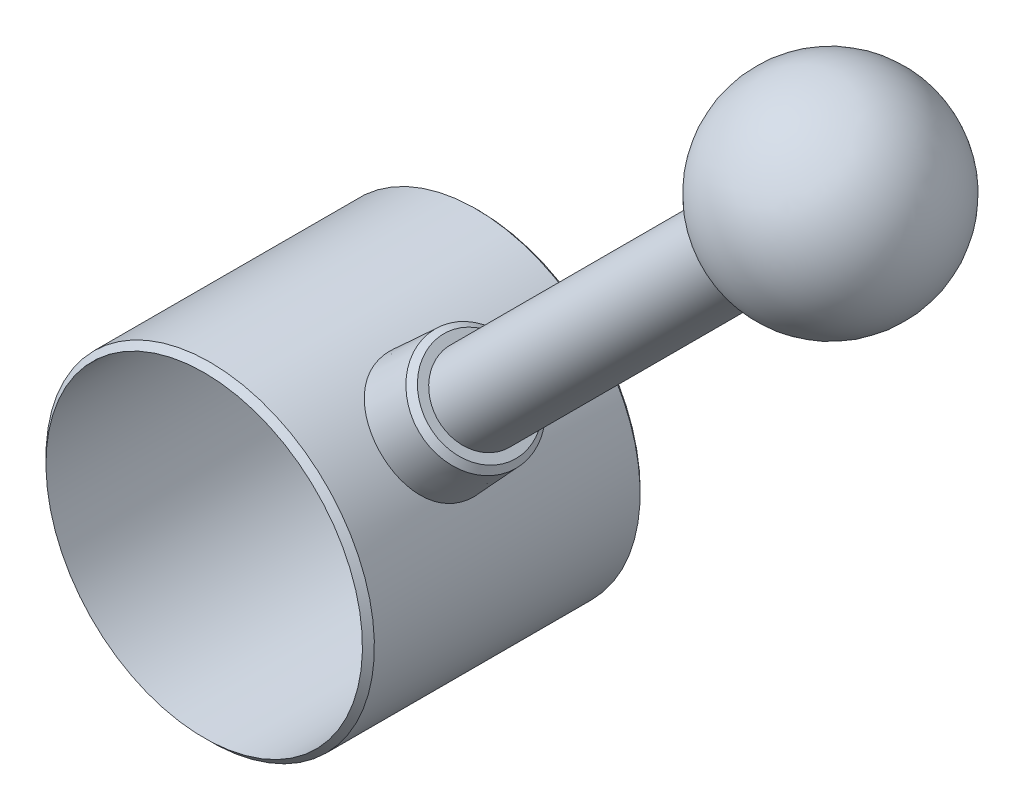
ISO-10303-21;
HEADER;
FILE_DESCRIPTION(('STEP AP214'),'2;1');
FILE_NAME('part.step','',(''),(''),'','','');
FILE_SCHEMA(('AUTOMOTIVE_DESIGN { 1 0 10303 214 1 1 1 1 }'));
ENDSEC;
DATA;
#1=APPLICATION_CONTEXT('core data for automotive mechanical design processes');
#2=APPLICATION_PROTOCOL_DEFINITION('international standard','automotive_design',2000,#1);
#3=PRODUCT_CONTEXT('',#1,'mechanical');
#4=PRODUCT('Part','Part','',(#3));
#5=PRODUCT_RELATED_PRODUCT_CATEGORY('part','',(#4));
#6=PRODUCT_DEFINITION_FORMATION('','',#4);
#7=PRODUCT_DEFINITION_CONTEXT('part definition',#1,'design');
#8=PRODUCT_DEFINITION('design','',#6,#7);
#9=PRODUCT_DEFINITION_SHAPE('','',#8);
#10=(LENGTH_UNIT() NAMED_UNIT(*) SI_UNIT(.MILLI.,.METRE.));
#11=(NAMED_UNIT(*) PLANE_ANGLE_UNIT() SI_UNIT($,.RADIAN.));
#12=(NAMED_UNIT(*) SI_UNIT($,.STERADIAN.) SOLID_ANGLE_UNIT());
#13=UNCERTAINTY_MEASURE_WITH_UNIT(LENGTH_MEASURE(1.E-05),#10,'distance_accuracy_value','');
#14=(GEOMETRIC_REPRESENTATION_CONTEXT(3) GLOBAL_UNCERTAINTY_ASSIGNED_CONTEXT((#13)) GLOBAL_UNIT_ASSIGNED_CONTEXT((#10,
#11,#12)) REPRESENTATION_CONTEXT('',''));
#15=CARTESIAN_POINT('',(0.,0.,0.));
#16=DIRECTION('',(0.,0.,1.));
#17=DIRECTION('',(1.,0.,0.));
#18=AXIS2_PLACEMENT_3D('',#15,#16,#17);
#19=CARTESIAN_POINT('',(84.8528137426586,84.8528137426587,25.999999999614));
#20=DIRECTION('',(-0.707106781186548,-0.707106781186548,0.));
#21=DIRECTION('',(0.,0.,1.));
#22=AXIS2_PLACEMENT_3D('',#19,#20,#21);
#23=SPHERICAL_SURFACE('',#22,17.5);
#24=CARTESIAN_POINT('',(97.2271824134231,97.2271824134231,26.0000001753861));
#25=VERTEX_POINT('',#24);
#26=VERTEX_LOOP('',#25);
#27=FACE_BOUND('',#26,.T.);
#28=CARTESIAN_POINT('',(73.8926586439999,73.892658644,26.));
#29=DIRECTION('',(-0.707106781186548,-0.707106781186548,0.));
#30=DIRECTION('',(0.707106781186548,-0.707106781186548,0.));
#31=AXIS2_PLACEMENT_3D('',#28,#29,#30);
#32=CIRCLE('',#31,8.12403843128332);
#33=CARTESIAN_POINT('',(79.6372213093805,68.1480959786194,26.));
#34=VERTEX_POINT('',#33);
#35=EDGE_CURVE('E18',#34,#34,#32,.T.);
#36=ORIENTED_EDGE('',*,*,#35,.F.);
#37=EDGE_LOOP('',(#36));
#38=FACE_BOUND('',#37,.T.);
#39=ADVANCED_FACE('F14',(#27,#38),#23,.T.);
#40=CARTESIAN_POINT('',(79.706156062,68.079161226,34.2215268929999));
#41=DIRECTION('',(-0.707106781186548,-0.707106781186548,0.));
#42=DIRECTION('',(-0.707106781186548,0.707106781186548,0.));
#43=AXIS2_PLACEMENT_3D('',#40,#41,#42);
#44=PLANE('',#43);
#45=CARTESIAN_POINT('',(73.8926586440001,73.8926586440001,26.));
#46=DIRECTION('',(-0.707106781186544,-0.707106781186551,0.));
#47=DIRECTION('',(0.707106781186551,-0.707106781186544,0.));
#48=AXIS2_PLACEMENT_3D('',#45,#46,#47);
#49=CIRCLE('',#48,6.99999999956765);
#50=CARTESIAN_POINT('',(78.8424061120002,68.942911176,26.));
#51=VERTEX_POINT('',#50);
#52=EDGE_CURVE('E34',#51,#51,#49,.F.);
#53=ORIENTED_EDGE('',*,*,#52,.T.);
#54=EDGE_LOOP('',(#53));
#55=FACE_BOUND('',#54,.T.);
#56=ORIENTED_EDGE('',*,*,#35,.T.);
#57=EDGE_LOOP('',(#56));
#58=FACE_BOUND('',#57,.T.);
#59=ADVANCED_FACE('F28',(#55,#58),#44,.T.);
#60=CARTESIAN_POINT('',(73.8926586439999,73.892658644,26.));
#61=DIRECTION('',(-0.707106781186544,-0.707106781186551,0.));
#62=DIRECTION('',(0.707106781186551,-0.707106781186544,0.));
#63=AXIS2_PLACEMENT_3D('',#60,#61,#62);
#64=CYLINDRICAL_SURFACE('',#63,6.99999999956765);
#65=ORIENTED_EDGE('',*,*,#52,.F.);
#66=EDGE_LOOP('',(#65));
#67=FACE_BOUND('',#66,.T.);
#68=CARTESIAN_POINT('',(26.1629509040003,26.1629509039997,26.));
#69=DIRECTION('',(-0.707106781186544,-0.707106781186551,0.));
#70=DIRECTION('',(0.707106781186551,-0.707106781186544,0.));
#71=AXIS2_PLACEMENT_3D('',#68,#69,#70);
#72=CIRCLE('',#71,6.99999999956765);
#73=CARTESIAN_POINT('',(31.1126983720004,21.2132034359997,26.));
#74=VERTEX_POINT('',#73);
#75=EDGE_CURVE('E37',#74,#74,#72,.T.);
#76=ORIENTED_EDGE('',*,*,#75,.F.);
#77=EDGE_LOOP('',(#76));
#78=FACE_BOUND('',#77,.T.);
#79=ADVANCED_FACE('F51',(#67,#78),#64,.T.);
#80=CARTESIAN_POINT('',(20.051210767,32.2746910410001,34.6433057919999));
#81=DIRECTION('',(0.707106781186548,0.707106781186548,0.));
#82=DIRECTION('',(0.707106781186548,-0.707106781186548,0.));
#83=AXIS2_PLACEMENT_3D('',#80,#81,#82);
#84=PLANE('',#83);
#85=ORIENTED_EDGE('',*,*,#75,.T.);
#86=EDGE_LOOP('',(#85));
#87=FACE_BOUND('',#86,.T.);
#88=CARTESIAN_POINT('',(26.1629509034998,26.1629509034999,26.));
#89=DIRECTION('',(-0.70710678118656,-0.707106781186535,0.));
#90=DIRECTION('',(0.707106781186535,-0.70710678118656,0.));
#91=AXIS2_PLACEMENT_3D('',#88,#89,#90);
#92=CIRCLE('',#91,8.54081600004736);
#93=CARTESIAN_POINT('',(32.2022198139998,20.1236819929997,26.));
#94=VERTEX_POINT('',#93);
#95=EDGE_CURVE('E77',#94,#94,#92,.F.);
#96=ORIENTED_EDGE('',*,*,#95,.T.);
#97=EDGE_LOOP('',(#96));
#98=FACE_BOUND('',#97,.T.);
#99=ADVANCED_FACE('F54',(#87,#98),#84,.T.);
#100=CARTESIAN_POINT('',(26.1629509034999,26.1629509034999,26.));
#101=DIRECTION('',(-0.70710678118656,-0.707106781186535,0.));
#102=DIRECTION('',(0.707106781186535,-0.70710678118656,0.));
#103=AXIS2_PLACEMENT_3D('',#100,#101,#102);
#104=CONICAL_SURFACE('',#103,8.54081600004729,0.785398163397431);
#105=ORIENTED_EDGE('',*,*,#95,.F.);
#106=EDGE_LOOP('',(#105));
#107=FACE_BOUND('',#106,.T.);
#108=CARTESIAN_POINT('',(25.4558441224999,25.4558441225,26.));
#109=DIRECTION('',(-0.707106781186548,-0.707106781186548,0.));
#110=DIRECTION('',(-0.707106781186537,0.707106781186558,0.));
#111=AXIS2_PLACEMENT_3D('',#108,#109,#110);
#112=CIRCLE('',#111,9.54081599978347);
#113=CARTESIAN_POINT('',(18.709468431,32.2022198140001,26.));
#114=VERTEX_POINT('',#113);
#115=EDGE_CURVE('E75',#114,#114,#112,.F.);
#116=ORIENTED_EDGE('',*,*,#115,.T.);
#117=EDGE_LOOP('',(#116));
#118=FACE_BOUND('',#117,.T.);
#119=ADVANCED_FACE('F56',(#107,#118),#104,.T.);
#120=CARTESIAN_POINT('',(25.4558441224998,25.4558441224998,26.));
#121=DIRECTION('',(-0.70710678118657,-0.707106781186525,0.));
#122=DIRECTION('',(0.707106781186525,-0.70710678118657,0.));
#123=AXIS2_PLACEMENT_3D('',#120,#121,#122);
#124=CONICAL_SURFACE('',#123,9.54081599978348,0.0407937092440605);
#125=ORIENTED_EDGE('',*,*,#115,.F.);
#126=EDGE_LOOP('',(#125));
#127=FACE_BOUND('',#126,.T.);
#128=CARTESIAN_POINT('',(11.0785009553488,25.1697599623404,26.0000000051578));
#129=CARTESIAN_POINT('',(11.0785003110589,25.1697600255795,26.2654053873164));
#130=CARTESIAN_POINT('',(11.08909680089,25.1651041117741,26.530804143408));
#131=CARTESIAN_POINT('',(11.1313063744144,25.1464619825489,27.0596893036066));
#132=CARTESIAN_POINT('',(11.1629269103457,25.1324724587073,27.3231749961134));
#133=CARTESIAN_POINT('',(11.2467174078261,25.0950881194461,27.8465436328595));
#134=CARTESIAN_POINT('',(11.2989153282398,25.0716805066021,28.1064211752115));
#135=CARTESIAN_POINT('',(11.4230184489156,25.015380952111,28.6203848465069));
#136=CARTESIAN_POINT('',(11.4949248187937,24.9824884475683,28.8744706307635));
#137=CARTESIAN_POINT('',(11.6570932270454,24.9072305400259,29.3743627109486));
#138=CARTESIAN_POINT('',(11.7472969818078,24.8648951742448,29.6201924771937));
#139=CARTESIAN_POINT('',(11.9449322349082,24.7705586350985,30.1029023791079));
#140=CARTESIAN_POINT('',(12.0523640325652,24.7185572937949,30.3397823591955));
#141=CARTESIAN_POINT('',(12.2830337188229,24.6047477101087,30.8031748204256));
#142=CARTESIAN_POINT('',(12.4062674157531,24.5429420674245,31.0296900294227));
#143=CARTESIAN_POINT('',(12.6671456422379,24.4093199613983,31.4712812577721));
#144=CARTESIAN_POINT('',(12.8047954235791,24.3374998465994,31.6863530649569));
#145=CARTESIAN_POINT('',(13.0997487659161,24.1800706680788,32.1136848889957));
#146=CARTESIAN_POINT('',(13.2576721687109,24.0939719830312,32.325337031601));
#147=CARTESIAN_POINT('',(13.5858849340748,23.9104386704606,32.7336069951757));
#148=CARTESIAN_POINT('',(13.75617467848,23.8130036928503,32.9302243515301));
#149=CARTESIAN_POINT('',(14.1074422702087,23.6066003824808,33.3073931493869));
#150=CARTESIAN_POINT('',(14.2884252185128,23.4976265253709,33.4879368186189));
#151=CARTESIAN_POINT('',(14.6591448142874,23.2681535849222,33.8316954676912));
#152=CARTESIAN_POINT('',(14.8488776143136,23.1476595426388,33.9949179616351));
#153=CARTESIAN_POINT('',(15.2431510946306,22.8900412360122,34.3092760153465));
#154=CARTESIAN_POINT('',(15.4479804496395,22.7524433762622,34.4596626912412));
#155=CARTESIAN_POINT('',(15.8631254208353,22.4649719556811,34.7394635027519));
#156=CARTESIAN_POINT('',(16.0734388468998,22.3151032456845,34.8688858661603));
#157=CARTESIAN_POINT('',(16.4975608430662,22.0034028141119,35.1057629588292));
#158=CARTESIAN_POINT('',(16.7113694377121,21.8415710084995,35.2132175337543));
#159=CARTESIAN_POINT('',(17.1403801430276,21.5065437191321,35.4051825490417));
#160=CARTESIAN_POINT('',(17.3555821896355,21.3333487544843,35.4896940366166));
#161=CARTESIAN_POINT('',(17.7780744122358,20.9824433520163,35.6325119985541));
#162=CARTESIAN_POINT('',(17.9853875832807,20.8050798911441,35.6916032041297));
#163=CARTESIAN_POINT('',(18.3975204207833,20.4415442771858,35.7870184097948));
#164=CARTESIAN_POINT('',(18.6023401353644,20.2553722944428,35.8233428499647));
#165=CARTESIAN_POINT('',(19.0076643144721,19.8755081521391,35.8728504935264));
#166=CARTESIAN_POINT('',(19.2081698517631,19.6818178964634,35.886039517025));
#167=CARTESIAN_POINT('',(19.6032714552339,19.2883248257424,35.8891567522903));
#168=CARTESIAN_POINT('',(19.7978676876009,19.0885221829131,35.8790856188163));
#169=CARTESIAN_POINT('',(20.1712017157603,18.6933999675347,35.8367518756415));
#170=CARTESIAN_POINT('',(20.3502600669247,18.4982746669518,35.8054934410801));
#171=CARTESIAN_POINT('',(20.7005213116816,18.1054594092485,35.7221261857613));
#172=CARTESIAN_POINT('',(20.8717244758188,17.907769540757,35.6700180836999));
#173=CARTESIAN_POINT('',(21.2053634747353,17.5114155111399,35.5454157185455));
#174=CARTESIAN_POINT('',(21.3677989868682,17.3127513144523,35.4729207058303));
#175=CARTESIAN_POINT('',(21.6831756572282,16.9160900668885,35.3081586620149));
#176=CARTESIAN_POINT('',(21.83611659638,16.7180930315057,35.2158911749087));
#177=CARTESIAN_POINT('',(22.1337427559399,16.3220564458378,35.0110932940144));
#178=CARTESIAN_POINT('',(22.2783070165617,16.1240448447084,34.8983332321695));
#179=CARTESIAN_POINT('',(22.5568445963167,15.7320249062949,34.6541121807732));
#180=CARTESIAN_POINT('',(22.6908140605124,15.5380180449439,34.5226444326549));
#181=CARTESIAN_POINT('',(22.9478997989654,15.1557565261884,34.2419394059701));
#182=CARTESIAN_POINT('',(23.0710159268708,14.9675019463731,34.0927018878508));
#183=CARTESIAN_POINT('',(23.3063245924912,14.5983954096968,33.7773945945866));
#184=CARTESIAN_POINT('',(23.4185164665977,14.4175439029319,33.6113237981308));
#185=CARTESIAN_POINT('',(23.637445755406,14.0558916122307,33.2544461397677));
#186=CARTESIAN_POINT('',(23.7436133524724,13.8755636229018,33.0628097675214));
#187=CARTESIAN_POINT('',(23.9440292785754,13.526785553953,32.6631841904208));
#188=CARTESIAN_POINT('',(24.0382772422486,13.358335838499,32.4551944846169));
#189=CARTESIAN_POINT('',(24.2150802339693,13.0351007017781,32.0239667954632));
#190=CARTESIAN_POINT('',(24.2976288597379,12.8803227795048,31.800720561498));
#191=CARTESIAN_POINT('',(24.4511757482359,12.5864015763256,31.3404016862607));
#192=CARTESIAN_POINT('',(24.5221746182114,12.4472574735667,31.1033297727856));
#193=CARTESIAN_POINT('',(24.6538029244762,12.1844951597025,30.613193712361));
#194=CARTESIAN_POINT('',(24.7142644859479,12.0611354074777,30.3599456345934));
#195=CARTESIAN_POINT('',(24.823704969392,11.8342528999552,29.8424478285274));
#196=CARTESIAN_POINT('',(24.8726888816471,11.7307215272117,29.5782029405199));
#197=CARTESIAN_POINT('',(24.9593152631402,11.5452610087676,29.0409328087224));
#198=CARTESIAN_POINT('',(24.9969767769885,11.4632956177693,28.7679231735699));
#199=CARTESIAN_POINT('',(25.0611980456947,11.3222070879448,28.2149076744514));
#200=CARTESIAN_POINT('',(25.0877629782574,11.263073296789,27.9349051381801));
#201=CARTESIAN_POINT('',(25.1291713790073,11.1703728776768,27.3800896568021));
#202=CARTESIAN_POINT('',(25.1443965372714,11.1359751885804,27.1054439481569));
#203=CARTESIAN_POINT('',(25.1646907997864,11.0900395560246,26.5538630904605));
#204=CARTESIAN_POINT('',(25.1697598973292,11.0785016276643,26.2769279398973));
#205=CARTESIAN_POINT('',(25.1697600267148,11.0785003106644,25.7345946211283));
#206=CARTESIAN_POINT('',(25.1651041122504,11.0890968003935,25.469195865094));
#207=CARTESIAN_POINT('',(25.1464619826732,11.1313063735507,24.9403107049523));
#208=CARTESIAN_POINT('',(25.1324724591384,11.1629269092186,24.6768250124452));
#209=CARTESIAN_POINT('',(25.095088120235,11.246717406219,24.153456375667));
#210=CARTESIAN_POINT('',(25.0716805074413,11.2989153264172,23.8935788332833));
#211=CARTESIAN_POINT('',(25.015380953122,11.4230184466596,23.3796151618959));
#212=CARTESIAN_POINT('',(24.9824884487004,11.4949248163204,23.1255293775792));
#213=CARTESIAN_POINT('',(24.907230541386,11.6570932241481,22.6256372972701));
#214=CARTESIAN_POINT('',(24.8648951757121,11.7472969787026,22.3798075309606));
#215=CARTESIAN_POINT('',(24.7705586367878,11.9449322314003,21.897097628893));
#216=CARTESIAN_POINT('',(24.7185572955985,12.052364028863,21.6602176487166));
#217=CARTESIAN_POINT('',(24.6047477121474,12.2830337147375,21.1968251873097));
#218=CARTESIAN_POINT('',(24.5429420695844,12.4062674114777,20.9703099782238));
#219=CARTESIAN_POINT('',(24.4093199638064,12.6671456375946,20.5287187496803));
#220=CARTESIAN_POINT('',(24.3374998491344,12.804795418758,20.3136469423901));
#221=CARTESIAN_POINT('',(24.1800706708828,13.0997487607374,19.8863151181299));
#222=CARTESIAN_POINT('',(24.0939719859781,13.2576721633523,19.6746629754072));
#223=CARTESIAN_POINT('',(23.9104386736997,13.5858849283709,19.2663930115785));
#224=CARTESIAN_POINT('',(23.8130036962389,13.7561746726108,19.0697756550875));
#225=CARTESIAN_POINT('',(23.6066003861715,14.1074422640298,18.692606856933));
#226=CARTESIAN_POINT('',(23.497626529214,14.2884252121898,18.5120631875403));
#227=CARTESIAN_POINT('',(23.2681535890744,14.6591448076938,18.1683045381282));
#228=CARTESIAN_POINT('',(23.1476595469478,14.8488776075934,18.0050820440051));
#229=CARTESIAN_POINT('',(22.8900412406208,15.2431510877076,17.6907239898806));
#230=CARTESIAN_POINT('',(22.7524433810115,15.4479804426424,17.5403373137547));
#231=CARTESIAN_POINT('',(22.4649719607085,15.8631254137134,17.2605365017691));
#232=CARTESIAN_POINT('',(22.3151032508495,16.0734388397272,17.1311141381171));
#233=CARTESIAN_POINT('',(22.0034028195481,16.4975608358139,16.8942370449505));
#234=CARTESIAN_POINT('',(21.8415710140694,16.7113694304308,16.7867824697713));
#235=CARTESIAN_POINT('',(21.5065437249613,17.140380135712,16.5948174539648));
#236=CARTESIAN_POINT('',(21.3333487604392,17.3555821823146,16.5103059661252));
#237=CARTESIAN_POINT('',(20.9824433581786,17.7780744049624,16.3674880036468));
#238=CARTESIAN_POINT('',(20.805079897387,17.9853875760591,16.3083967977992));
#239=CARTESIAN_POINT('',(20.4415442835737,18.3975204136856,16.2129815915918));
#240=CARTESIAN_POINT('',(20.2553723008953,18.6023401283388,16.1766571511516));
#241=CARTESIAN_POINT('',(19.8755081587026,19.0076643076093,16.1271495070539));
#242=CARTESIAN_POINT('',(19.6818179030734,19.2081698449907,16.1139604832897));
#243=CARTESIAN_POINT('',(19.2883248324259,19.6032714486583,16.1108432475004));
#244=CARTESIAN_POINT('',(19.0885221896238,19.7978676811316,16.120914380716));
#245=CARTESIAN_POINT('',(18.6933999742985,20.1712017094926,16.1632481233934));
#246=CARTESIAN_POINT('',(18.4982746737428,20.3502600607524,16.194506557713));
#247=CARTESIAN_POINT('',(18.1054594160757,20.700521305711,16.2778738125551));
#248=CARTESIAN_POINT('',(17.9077695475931,20.8717244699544,16.3299819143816));
#249=CARTESIAN_POINT('',(17.5114155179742,21.2053634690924,16.4545842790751));
#250=CARTESIAN_POINT('',(17.3127513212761,21.3677989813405,16.5270792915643));
#251=CARTESIAN_POINT('',(16.9160900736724,21.6831756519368,16.6918413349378));
#252=CARTESIAN_POINT('',(16.7180930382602,21.8361165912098,16.7841088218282));
#253=CARTESIAN_POINT('',(16.3220564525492,22.1337427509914,16.9889067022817));
#254=CARTESIAN_POINT('',(16.1240448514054,22.2783070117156,17.1016667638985));
#255=CARTESIAN_POINT('',(15.732024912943,22.5568445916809,17.3458878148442));
#256=CARTESIAN_POINT('',(15.5380180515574,22.6908140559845,17.47735556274));
#257=CARTESIAN_POINT('',(15.1557565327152,22.9478997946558,17.7580605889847));
#258=CARTESIAN_POINT('',(14.9675019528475,23.0710159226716,17.9072981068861));
#259=CARTESIAN_POINT('',(14.5983954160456,23.3063245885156,18.2226053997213));
#260=CARTESIAN_POINT('',(14.4175439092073,23.4185164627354,18.388676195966));
#261=CARTESIAN_POINT('',(14.055891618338,23.6374457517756,18.7455538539));
#262=CARTESIAN_POINT('',(13.8755636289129,23.7436133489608,18.9371902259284));
#263=CARTESIAN_POINT('',(13.5267855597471,23.9440292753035,19.3368158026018));
#264=CARTESIAN_POINT('',(13.358335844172,24.0382772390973,19.5448055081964));
#265=CARTESIAN_POINT('',(13.0351007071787,24.2150802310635,19.9760331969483));
#266=CARTESIAN_POINT('',(12.8803227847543,24.2976288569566,20.1992794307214));
#267=CARTESIAN_POINT('',(12.586401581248,24.4511757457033,20.6595983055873));
#268=CARTESIAN_POINT('',(12.4472574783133,24.522174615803,20.8966702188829));
#269=CARTESIAN_POINT('',(12.1844951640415,24.6538029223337,21.3868062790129));
#270=CARTESIAN_POINT('',(12.0611354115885,24.7142644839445,21.640054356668));
#271=CARTESIAN_POINT('',(11.8342529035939,24.8237049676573,22.1575521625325));
#272=CARTESIAN_POINT('',(11.7307215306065,24.8726888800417,22.4217970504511));
#273=CARTESIAN_POINT('',(11.5452610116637,24.9593152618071,22.9590671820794));
#274=CARTESIAN_POINT('',(11.4632956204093,24.996976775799,23.2320768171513));
#275=CARTESIAN_POINT('',(11.3222070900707,25.061198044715,23.7850923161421));
#276=CARTESIAN_POINT('',(11.2630732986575,25.0877629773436,24.0650948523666));
#277=CARTESIAN_POINT('',(11.1703728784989,25.1291713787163,24.619910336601));
#278=CARTESIAN_POINT('',(11.1359751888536,25.144396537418,24.8945560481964));
#279=CARTESIAN_POINT('',(11.0900395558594,25.1646907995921,25.4461369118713));
#280=CARTESIAN_POINT('',(11.0785016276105,25.1697598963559,25.723072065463));
#281=CARTESIAN_POINT('',(11.0785009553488,25.1697599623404,26.0000000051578));
#282=B_SPLINE_CURVE_WITH_KNOTS('',3,(#128,#129,#130,#131,#132,#133,#134,#135,#136,#137,#138,
#139,#140,#141,#142,#143,#144,#145,#146,#147,#148,#149,#150,#151,#152,#153,#154,#155,#156,#157,
#158,#159,#160,#161,#162,#163,#164,#165,#166,#167,#168,#169,#170,#171,#172,#173,#174,#175,#176,
#177,#178,#179,#180,#181,#182,#183,#184,#185,#186,#187,#188,#189,#190,#191,#192,#193,#194,#195,
#196,#197,#198,#199,#200,#201,#202,#203,#204,#205,#206,#207,#208,#209,#210,#211,#212,#213,#214,
#215,#216,#217,#218,#219,#220,#221,#222,#223,#224,#225,#226,#227,#228,#229,#230,#231,#232,#233,
#234,#235,#236,#237,#238,#239,#240,#241,#242,#243,#244,#245,#246,#247,#248,#249,#250,#251,#252,
#253,#254,#255,#256,#257,#258,#259,#260,#261,#262,#263,#264,#265,#266,#267,#268,#269,#270,#271,
#272,#273,#274,#275,#276,#277,#278,#279,#280,#281),.UNSPECIFIED.,.T.,.F.,(4,2,2,2,2,2,2,2,2,2,2,
2,2,2,2,2,2,2,2,2,2,2,2,2,2,2,2,2,2,2,2,2,2,2,2,2,2,2,2,2,2,2,2,2,2,2,2,2,2,2,2,2,2,2,2,2,2,2,2,
2,2,2,2,2,2,2,2,2,2,2,2,2,2,2,2,2,4),(0.,0.7959540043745,1.59219029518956,2.38951219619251,
3.1868814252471,3.98174955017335,4.77663148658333,5.57130300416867,6.36626503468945,
7.1986119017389,8.03098448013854,8.86375738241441,9.69616752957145,10.562014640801,
11.4275211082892,12.2930336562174,13.1585066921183,13.9949144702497,14.8313060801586,
15.6674872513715,16.5036448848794,17.3027126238,18.1017528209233,18.9008224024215,
19.6999104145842,20.5085786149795,21.3175397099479,22.1265117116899,22.935532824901,
23.7858058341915,24.6361048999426,25.4868674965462,26.3375853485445,27.2008157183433,
28.0636700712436,28.9250648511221,29.7860572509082,30.616566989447,31.4470772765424,
32.2430312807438,33.0392675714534,33.8365894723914,34.6339587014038,35.428826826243,
36.223708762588,37.0183802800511,37.8133423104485,38.645689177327,39.4780617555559,
40.3108346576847,41.143244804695,42.0090919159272,42.8745983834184,43.7401109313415,
44.6055839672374,45.4419917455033,46.2783833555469,47.1145645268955,47.9507221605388,
48.7497898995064,49.5488300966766,50.3478996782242,51.1469876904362,51.9556558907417,
52.7646169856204,53.5735889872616,54.3826101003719,55.232883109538,56.0831821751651,
56.9339447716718,57.7846626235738,58.6478929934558,59.5107473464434,60.3721421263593,
61.2331345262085,62.0636442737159,62.8941545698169),.UNSPECIFIED.);
#283=CARTESIAN_POINT('',(11.0785009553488,25.1697599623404,26.0000000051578));
#284=VERTEX_POINT('',#283);
#285=EDGE_CURVE('E68',#284,#284,#282,.T.);
#286=ORIENTED_EDGE('',*,*,#285,.T.);
#287=EDGE_LOOP('',(#286));
#288=FACE_BOUND('',#287,.T.);
#289=ADVANCED_FACE('F59',(#127,#288),#124,.T.);
#290=CARTESIAN_POINT('',(0.,0.,46.5));
#291=DIRECTION('',(0.,0.,-1.));
#292=DIRECTION('',(1.,0.,0.));
#293=AXIS2_PLACEMENT_3D('',#290,#291,#292);
#294=CONICAL_SURFACE('',#293,26.0000000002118,0.78539816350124);
#295=CARTESIAN_POINT('',(0.,0.,46.0000000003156));
#296=DIRECTION('',(0.,0.,-1.));
#297=DIRECTION('',(0.,1.,0.));
#298=AXIS2_PLACEMENT_3D('',#295,#296,#297);
#299=CIRCLE('',#298,26.5);
#300=CARTESIAN_POINT('',(0.,26.5,46.0000000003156));
#301=VERTEX_POINT('',#300);
#302=EDGE_CURVE('E35',#301,#301,#299,.T.);
#303=ORIENTED_EDGE('',*,*,#302,.T.);
#304=EDGE_LOOP('',(#303));
#305=FACE_BOUND('',#304,.T.);
#306=CARTESIAN_POINT('',(0.,0.,45.));
#307=DIRECTION('',(0.,0.,-1.));
#308=DIRECTION('',(-0.707106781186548,0.707106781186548,0.));
#309=AXIS2_PLACEMENT_3D('',#306,#307,#308);
#310=CIRCLE('',#309,27.5000000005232);
#311=CARTESIAN_POINT('',(-19.445436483,19.445436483,45.));
#312=VERTEX_POINT('',#311);
#313=EDGE_CURVE('E74',#312,#312,#310,.F.);
#314=ORIENTED_EDGE('',*,*,#313,.T.);
#315=EDGE_LOOP('',(#314));
#316=FACE_BOUND('',#315,.T.);
#317=ADVANCED_FACE('F64',(#305,#316),#294,.T.);
#318=CARTESIAN_POINT('',(0.,0.,45.));
#319=DIRECTION('',(0.,0.,-1.));
#320=DIRECTION('',(1.,0.,0.));
#321=AXIS2_PLACEMENT_3D('',#318,#319,#320);
#322=CYLINDRICAL_SURFACE('',#321,27.5000000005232);
#323=ORIENTED_EDGE('',*,*,#313,.F.);
#324=EDGE_LOOP('',(#323));
#325=FACE_BOUND('',#324,.T.);
#326=CARTESIAN_POINT('',(0.,0.,0.499999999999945));
#327=DIRECTION('',(0.,0.,1.));
#328=DIRECTION('',(0.707106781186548,-0.707106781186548,0.));
#329=AXIS2_PLACEMENT_3D('',#326,#327,#328);
#330=CIRCLE('',#329,27.5000000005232);
#331=CARTESIAN_POINT('',(19.445436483,-19.445436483,0.50000000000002));
#332=VERTEX_POINT('',#331);
#333=EDGE_CURVE('E22',#332,#332,#330,.T.);
#334=ORIENTED_EDGE('',*,*,#333,.T.);
#335=EDGE_LOOP('',(#334));
#336=FACE_BOUND('',#335,.T.);
#337=ORIENTED_EDGE('',*,*,#285,.F.);
#338=EDGE_LOOP('',(#337));
#339=FACE_BOUND('',#338,.T.);
#340=ADVANCED_FACE('F79',(#325,#336,#339),#322,.T.);
#341=CARTESIAN_POINT('',(0.,0.,0.));
#342=DIRECTION('',(0.,0.,1.));
#343=DIRECTION('',(-1.,0.,0.));
#344=AXIS2_PLACEMENT_3D('',#341,#342,#343);
#345=CONICAL_SURFACE('',#344,26.999999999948,0.785398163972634);
#346=CARTESIAN_POINT('',(0.,0.,0.));
#347=DIRECTION('',(0.,0.,1.));
#348=DIRECTION('',(-1.,0.,0.));
#349=AXIS2_PLACEMENT_3D('',#346,#347,#348);
#350=CIRCLE('',#349,26.999999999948);
#351=CARTESIAN_POINT('',(-26.999999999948,0.,0.));
#352=VERTEX_POINT('',#351);
#353=EDGE_CURVE('E9',#352,#352,#350,.T.);
#354=ORIENTED_EDGE('',*,*,#353,.T.);
#355=EDGE_LOOP('',(#354));
#356=FACE_BOUND('',#355,.T.);
#357=ORIENTED_EDGE('',*,*,#333,.F.);
#358=EDGE_LOOP('',(#357));
#359=FACE_BOUND('',#358,.T.);
#360=ADVANCED_FACE('F83',(#356,#359),#345,.T.);
#361=CARTESIAN_POINT('',(-38.641971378,0.,0.));
#362=DIRECTION('',(0.,0.,1.));
#363=DIRECTION('',(0.707106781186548,-0.707106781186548,0.));
#364=AXIS2_PLACEMENT_3D('',#361,#362,#363);
#365=PLANE('',#364);
#366=CARTESIAN_POINT('',(0.,0.,0.));
#367=DIRECTION('',(0.,0.,-1.));
#368=DIRECTION('',(0.,1.,0.));
#369=AXIS2_PLACEMENT_3D('',#366,#367,#368);
#370=CIRCLE('',#369,26.5);
#371=CARTESIAN_POINT('',(0.,26.5,0.));
#372=VERTEX_POINT('',#371);
#373=EDGE_CURVE('E39',#372,#372,#370,.T.);
#374=ORIENTED_EDGE('',*,*,#373,.F.);
#375=EDGE_LOOP('',(#374));
#376=FACE_BOUND('',#375,.T.);
#377=ORIENTED_EDGE('',*,*,#353,.F.);
#378=EDGE_LOOP('',(#377));
#379=FACE_BOUND('',#378,.T.);
#380=ADVANCED_FACE('F16',(#376,#379),#365,.F.);
#381=CARTESIAN_POINT('',(0.,0.,66.5));
#382=DIRECTION('',(0.,0.,-1.));
#383=DIRECTION('',(0.,1.,0.));
#384=AXIS2_PLACEMENT_3D('',#381,#382,#383);
#385=CYLINDRICAL_SURFACE('',#384,26.5);
#386=ORIENTED_EDGE('',*,*,#373,.T.);
#387=EDGE_LOOP('',(#386));
#388=FACE_BOUND('',#387,.T.);
#389=ORIENTED_EDGE('',*,*,#302,.F.);
#390=EDGE_LOOP('',(#389));
#391=FACE_BOUND('',#390,.T.);
#392=ADVANCED_FACE('F30',(#388,#391),#385,.F.);
#393=CLOSED_SHELL('',(#39,#59,#79,#99,#119,#289,#317,#340,#360,#380,#392));
#394=MANIFOLD_SOLID_BREP('B1',#393);
#395=ADVANCED_BREP_SHAPE_REPRESENTATION('',(#18,#394),#14);
#396=SHAPE_DEFINITION_REPRESENTATION(#9,#395);
ENDSEC;
END-ISO-10303-21;
